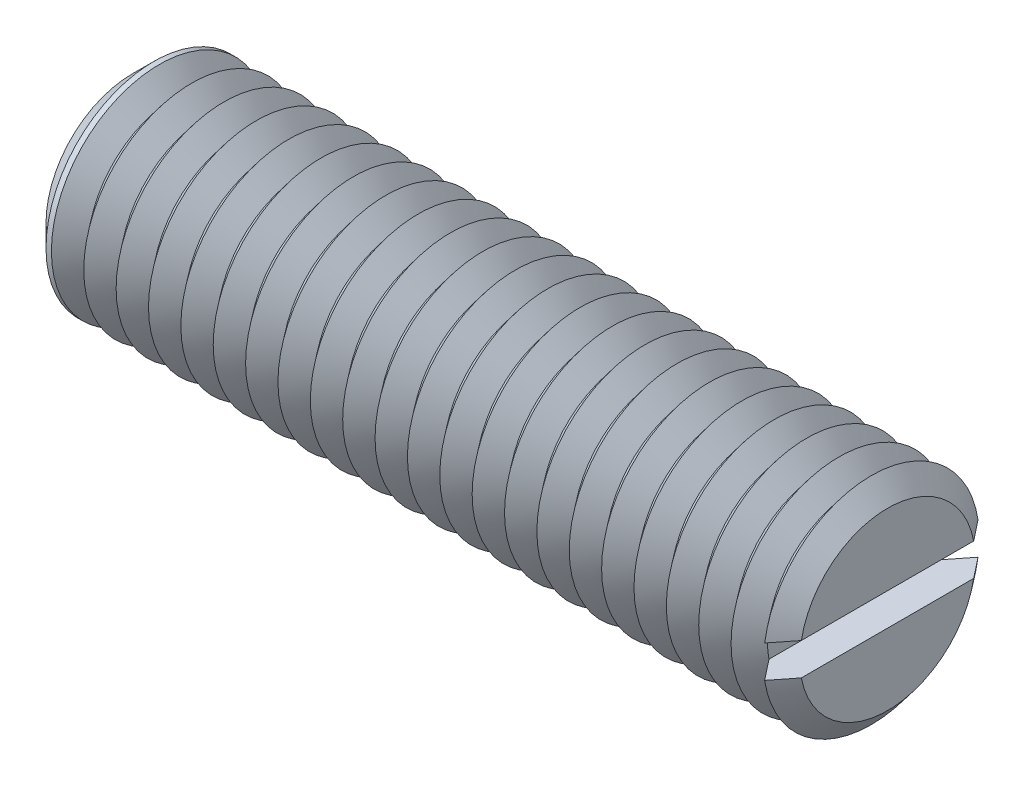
from build123d import *

# Parameters (mm, degrees)
SKETCH1_R       = 5
EXTRUDE1_DEPTH  = 17.5
SKETCH2_W       = 1.5
SKETCH2_H       = 1.5
EXTRUDE2_DEPTH  = 7.5
CHAMFER1_SIZE   = 1
LPATTERN1_COUNT = 23
LPATTERN1_PITCH = 1.5


with BuildPart() as part:
    # Sketch1 → Extrude1 (new, symmetric)
    with BuildSketch(Plane(origin=(0, 0, 0), x_dir=(0, 0, -1), z_dir=(1, 0, 0))):
        Circle(SKETCH1_R)
    extrude(amount=EXTRUDE1_DEPTH, both=True)

    # Sketch2 → Extrude2 (cut, symmetric)
    with BuildSketch(Plane.XY):
        with Locations((16.75, 0)):
            Rectangle(SKETCH2_W, SKETCH2_H)
    extrude(amount=EXTRUDE2_DEPTH, both=True, mode=Mode.SUBTRACT)

    # Chamfer1
    chamfer1_edges = [part.edges().sort_by_distance(p)[0] for p in [
        (-17.5, 0, 5),
    ]]
    chamfer(chamfer1_edges, length=CHAMFER1_SIZE)

    # Sketch3 → Cut-Revolve1 (revolve, cut)
    with BuildSketch(Plane.XY, mode=Mode.PRIVATE) as cut_revolve1_sk:
        Polygon((16.75, -5), (18.25, -5), (17.5, -4.0632503), align=None)
    cut_revolve1 = revolve(cut_revolve1_sk.sketch.rotate(Axis((0, 0, 0), (1, 0, 0)), 261.373073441), axis=Axis((0, 0, 0), (1, 0, 0)), mode=Mode.SUBTRACT)

    # LPattern1: Cut-Revolve1 ×23
    with Locations(*[(-i * LPATTERN1_PITCH, 0, 0) for i in range(1, LPATTERN1_COUNT)]):
        add(cut_revolve1, mode=Mode.SUBTRACT)


solid = part.part
